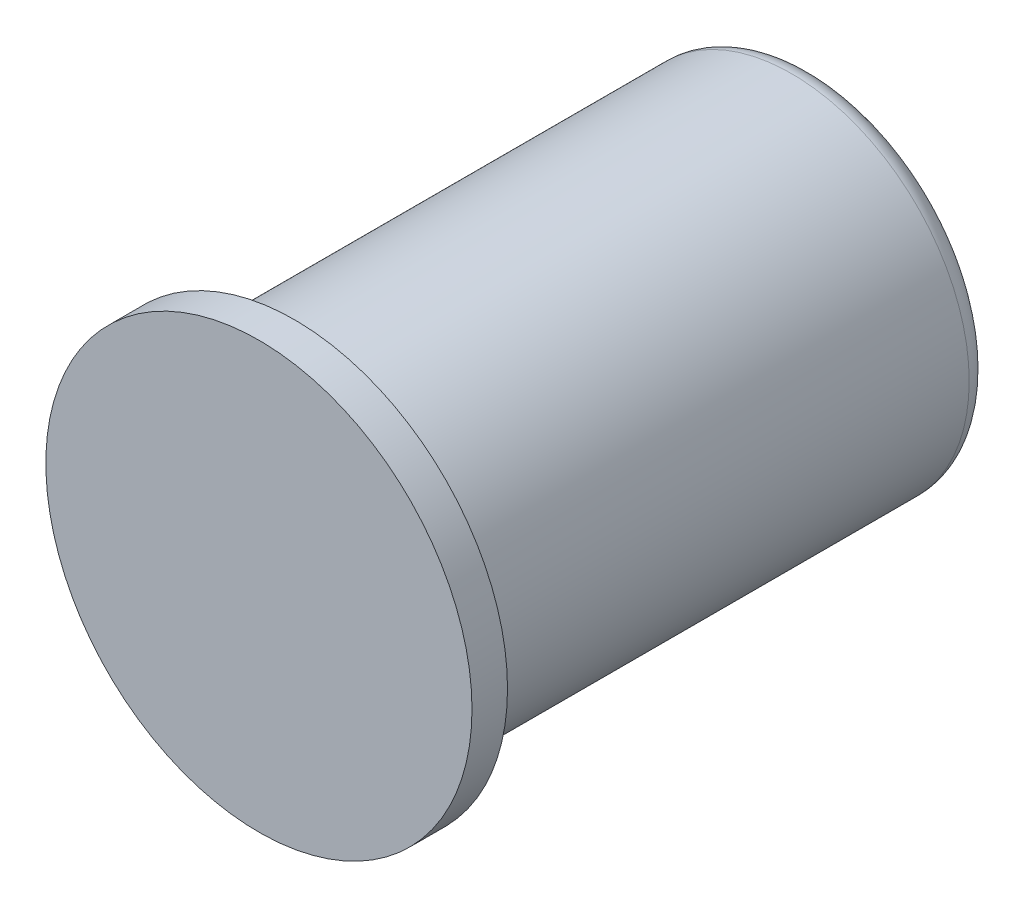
ISO-10303-21;
HEADER;
FILE_DESCRIPTION(('STEP AP214'),'2;1');
FILE_NAME('part.step','',(''),(''),'','','');
FILE_SCHEMA(('AUTOMOTIVE_DESIGN { 1 0 10303 214 1 1 1 1 }'));
ENDSEC;
DATA;
#1=APPLICATION_CONTEXT('core data for automotive mechanical design processes');
#2=APPLICATION_PROTOCOL_DEFINITION('international standard','automotive_design',2000,#1);
#3=PRODUCT_CONTEXT('',#1,'mechanical');
#4=PRODUCT('Part','Part','',(#3));
#5=PRODUCT_RELATED_PRODUCT_CATEGORY('part','',(#4));
#6=PRODUCT_DEFINITION_FORMATION('','',#4);
#7=PRODUCT_DEFINITION_CONTEXT('part definition',#1,'design');
#8=PRODUCT_DEFINITION('design','',#6,#7);
#9=PRODUCT_DEFINITION_SHAPE('','',#8);
#10=(LENGTH_UNIT() NAMED_UNIT(*) SI_UNIT(.MILLI.,.METRE.));
#11=(NAMED_UNIT(*) PLANE_ANGLE_UNIT() SI_UNIT($,.RADIAN.));
#12=(NAMED_UNIT(*) SI_UNIT($,.STERADIAN.) SOLID_ANGLE_UNIT());
#13=UNCERTAINTY_MEASURE_WITH_UNIT(LENGTH_MEASURE(1.E-05),#10,'distance_accuracy_value','');
#14=(GEOMETRIC_REPRESENTATION_CONTEXT(3) GLOBAL_UNCERTAINTY_ASSIGNED_CONTEXT((#13)) GLOBAL_UNIT_ASSIGNED_CONTEXT((#10,
#11,#12)) REPRESENTATION_CONTEXT('',''));
#15=CARTESIAN_POINT('',(0.,0.,0.));
#16=DIRECTION('',(0.,0.,1.));
#17=DIRECTION('',(1.,0.,0.));
#18=AXIS2_PLACEMENT_3D('',#15,#16,#17);
#19=CARTESIAN_POINT('',(0.,0.,0.));
#20=DIRECTION('',(0.,0.,-1.));
#21=DIRECTION('',(-1.,0.,0.));
#22=AXIS2_PLACEMENT_3D('',#19,#20,#21);
#23=PLANE('',#22);
#24=CARTESIAN_POINT('',(0.,0.,0.));
#25=DIRECTION('',(0.,0.,1.));
#26=DIRECTION('',(1.,0.,0.));
#27=AXIS2_PLACEMENT_3D('',#24,#25,#26);
#28=CIRCLE('',#27,30.);
#29=CARTESIAN_POINT('',(30.,0.,0.));
#30=VERTEX_POINT('',#29);
#31=EDGE_CURVE('E11',#30,#30,#28,.T.);
#32=ORIENTED_EDGE('',*,*,#31,.T.);
#33=EDGE_LOOP('',(#32));
#34=FACE_BOUND('',#33,.T.);
#35=ADVANCED_FACE('F32',(#34),#23,.F.);
#36=CARTESIAN_POINT('',(0.,0.,0.));
#37=DIRECTION('',(0.,0.,1.));
#38=DIRECTION('',(1.,0.,0.));
#39=AXIS2_PLACEMENT_3D('',#36,#37,#38);
#40=CYLINDRICAL_SURFACE('',#39,30.);
#41=ORIENTED_EDGE('',*,*,#31,.F.);
#42=EDGE_LOOP('',(#41));
#43=FACE_BOUND('',#42,.T.);
#44=CARTESIAN_POINT('',(0.,0.,-5.));
#45=DIRECTION('',(0.,0.,1.));
#46=DIRECTION('',(1.,0.,0.));
#47=AXIS2_PLACEMENT_3D('',#44,#45,#46);
#48=CIRCLE('',#47,30.);
#49=CARTESIAN_POINT('',(30.,0.,-5.));
#50=VERTEX_POINT('',#49);
#51=EDGE_CURVE('E38',#50,#50,#48,.T.);
#52=ORIENTED_EDGE('',*,*,#51,.T.);
#53=EDGE_LOOP('',(#52));
#54=FACE_BOUND('',#53,.T.);
#55=ADVANCED_FACE('F54',(#43,#54),#40,.T.);
#56=CARTESIAN_POINT('',(0.,30.,-5.));
#57=DIRECTION('',(0.,0.,1.));
#58=DIRECTION('',(1.,0.,0.));
#59=AXIS2_PLACEMENT_3D('',#56,#57,#58);
#60=PLANE('',#59);
#61=ORIENTED_EDGE('',*,*,#51,.F.);
#62=EDGE_LOOP('',(#61));
#63=FACE_BOUND('',#62,.T.);
#64=CARTESIAN_POINT('',(0.,0.,-5.));
#65=DIRECTION('',(0.,0.,1.));
#66=DIRECTION('',(1.,0.,0.));
#67=AXIS2_PLACEMENT_3D('',#64,#65,#66);
#68=CIRCLE('',#67,25.);
#69=CARTESIAN_POINT('',(25.,0.,-5.));
#70=VERTEX_POINT('',#69);
#71=EDGE_CURVE('E66',#70,#70,#68,.T.);
#72=ORIENTED_EDGE('',*,*,#71,.T.);
#73=EDGE_LOOP('',(#72));
#74=FACE_BOUND('',#73,.T.);
#75=ADVANCED_FACE('F59',(#63,#74),#60,.F.);
#76=CARTESIAN_POINT('',(0.,0.,0.));
#77=DIRECTION('',(0.,0.,1.));
#78=DIRECTION('',(1.,0.,0.));
#79=AXIS2_PLACEMENT_3D('',#76,#77,#78);
#80=CYLINDRICAL_SURFACE('',#79,25.);
#81=ORIENTED_EDGE('',*,*,#71,.F.);
#82=EDGE_LOOP('',(#81));
#83=FACE_BOUND('',#82,.T.);
#84=CARTESIAN_POINT('',(0.,0.,-75.));
#85=DIRECTION('',(0.,0.,1.));
#86=DIRECTION('',(1.,0.,0.));
#87=AXIS2_PLACEMENT_3D('',#84,#85,#86);
#88=CIRCLE('',#87,25.);
#89=CARTESIAN_POINT('',(25.,0.,-75.));
#90=VERTEX_POINT('',#89);
#91=EDGE_CURVE('E68',#90,#90,#88,.T.);
#92=ORIENTED_EDGE('',*,*,#91,.T.);
#93=EDGE_LOOP('',(#92));
#94=FACE_BOUND('',#93,.T.);
#95=ADVANCED_FACE('F101',(#83,#94),#80,.T.);
#96=CARTESIAN_POINT('',(0.,0.,-75.));
#97=DIRECTION('',(0.,0.,1.));
#98=DIRECTION('',(1.,0.,0.));
#99=AXIS2_PLACEMENT_3D('',#96,#97,#98);
#100=TOROIDAL_SURFACE('',#99,22.,3.);
#101=ORIENTED_EDGE('',*,*,#91,.F.);
#102=EDGE_LOOP('',(#101));
#103=FACE_BOUND('',#102,.T.);
#104=CARTESIAN_POINT('',(0.,0.,-78.));
#105=DIRECTION('',(0.,0.,1.));
#106=DIRECTION('',(1.,0.,0.));
#107=AXIS2_PLACEMENT_3D('',#104,#105,#106);
#108=CIRCLE('',#107,22.);
#109=CARTESIAN_POINT('',(22.,0.,-78.));
#110=VERTEX_POINT('',#109);
#111=EDGE_CURVE('E73',#110,#110,#108,.T.);
#112=ORIENTED_EDGE('',*,*,#111,.T.);
#113=EDGE_LOOP('',(#112));
#114=FACE_BOUND('',#113,.T.);
#115=ADVANCED_FACE('F94',(#103,#114),#100,.T.);
#116=CARTESIAN_POINT('',(0.,22.,-78.));
#117=DIRECTION('',(0.,0.,1.));
#118=DIRECTION('',(1.,0.,0.));
#119=AXIS2_PLACEMENT_3D('',#116,#117,#118);
#120=PLANE('',#119);
#121=ORIENTED_EDGE('',*,*,#111,.F.);
#122=EDGE_LOOP('',(#121));
#123=FACE_BOUND('',#122,.T.);
#124=CARTESIAN_POINT('',(0.,0.,-78.));
#125=DIRECTION('',(0.,0.,1.));
#126=DIRECTION('',(1.,0.,0.));
#127=AXIS2_PLACEMENT_3D('',#124,#125,#126);
#128=CIRCLE('',#127,4.49999999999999);
#129=CARTESIAN_POINT('',(4.49999999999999,0.,-78.));
#130=VERTEX_POINT('',#129);
#131=EDGE_CURVE('E76',#130,#130,#128,.T.);
#132=ORIENTED_EDGE('',*,*,#131,.T.);
#133=EDGE_LOOP('',(#132));
#134=FACE_BOUND('',#133,.T.);
#135=ADVANCED_FACE('F88',(#123,#134),#120,.F.);
#136=CARTESIAN_POINT('',(0.,0.,-77.5));
#137=DIRECTION('',(0.,0.,-1.));
#138=DIRECTION('',(-1.,0.,0.));
#139=AXIS2_PLACEMENT_3D('',#136,#137,#138);
#140=CONICAL_SURFACE('',#139,4.,0.785398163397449);
#141=ORIENTED_EDGE('',*,*,#131,.F.);
#142=EDGE_LOOP('',(#141));
#143=FACE_BOUND('',#142,.T.);
#144=CARTESIAN_POINT('',(0.,0.,-77.5));
#145=DIRECTION('',(0.,0.,1.));
#146=DIRECTION('',(1.,0.,0.));
#147=AXIS2_PLACEMENT_3D('',#144,#145,#146);
#148=CIRCLE('',#147,4.);
#149=CARTESIAN_POINT('',(4.,0.,-77.5));
#150=VERTEX_POINT('',#149);
#151=EDGE_CURVE('E79',#150,#150,#148,.T.);
#152=ORIENTED_EDGE('',*,*,#151,.T.);
#153=EDGE_LOOP('',(#152));
#154=FACE_BOUND('',#153,.T.);
#155=ADVANCED_FACE('F49',(#143,#154),#140,.F.);
#156=CARTESIAN_POINT('',(0.,0.,0.));
#157=DIRECTION('',(0.,0.,1.));
#158=DIRECTION('',(1.,0.,0.));
#159=AXIS2_PLACEMENT_3D('',#156,#157,#158);
#160=CYLINDRICAL_SURFACE('',#159,4.);
#161=ORIENTED_EDGE('',*,*,#151,.F.);
#162=EDGE_LOOP('',(#161));
#163=FACE_BOUND('',#162,.T.);
#164=CARTESIAN_POINT('',(0.,0.,-69.));
#165=DIRECTION('',(0.,0.,1.));
#166=DIRECTION('',(1.,0.,0.));
#167=AXIS2_PLACEMENT_3D('',#164,#165,#166);
#168=CIRCLE('',#167,4.);
#169=CARTESIAN_POINT('',(4.,0.,-69.));
#170=VERTEX_POINT('',#169);
#171=EDGE_CURVE('E82',#170,#170,#168,.T.);
#172=ORIENTED_EDGE('',*,*,#171,.T.);
#173=EDGE_LOOP('',(#172));
#174=FACE_BOUND('',#173,.T.);
#175=ADVANCED_FACE('F43',(#163,#174),#160,.F.);
#176=CARTESIAN_POINT('',(0.,0.,-66.6905989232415));
#177=DIRECTION('',(0.,0.,-1.));
#178=DIRECTION('',(-1.,0.,0.));
#179=AXIS2_PLACEMENT_3D('',#176,#177,#178);
#180=CONICAL_SURFACE('',#179,0.,1.04719755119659);
#181=ORIENTED_EDGE('',*,*,#171,.F.);
#182=EDGE_LOOP('',(#181));
#183=FACE_BOUND('',#182,.T.);
#184=CARTESIAN_POINT('',(0.,0.,-66.6905989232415));
#185=VERTEX_POINT('',#184);
#186=VERTEX_LOOP('',#185);
#187=FACE_BOUND('',#186,.T.);
#188=ADVANCED_FACE('F41',(#183,#187),#180,.F.);
#189=CLOSED_SHELL('',(#35,#55,#75,#95,#115,#135,#155,#175,#188));
#190=MANIFOLD_SOLID_BREP('B2',#189);
#191=ADVANCED_BREP_SHAPE_REPRESENTATION('',(#18,#190),#14);
#192=SHAPE_DEFINITION_REPRESENTATION(#9,#191);
ENDSEC;
END-ISO-10303-21;
